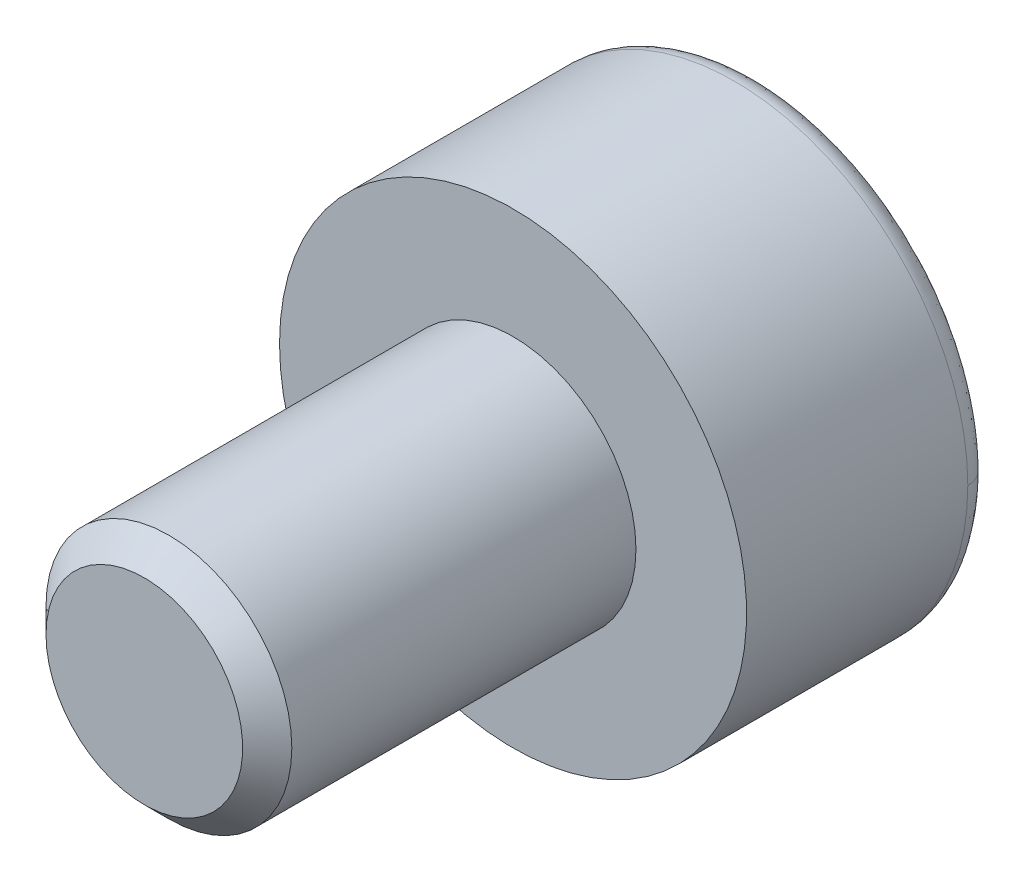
ISO-10303-21;
HEADER;
FILE_DESCRIPTION(('STEP AP214'),'2;1');
FILE_NAME('part.step','',(''),(''),'','','');
FILE_SCHEMA(('AUTOMOTIVE_DESIGN { 1 0 10303 214 1 1 1 1 }'));
ENDSEC;
DATA;
#1=APPLICATION_CONTEXT('core data for automotive mechanical design processes');
#2=APPLICATION_PROTOCOL_DEFINITION('international standard','automotive_design',2000,#1);
#3=PRODUCT_CONTEXT('',#1,'mechanical');
#4=PRODUCT('Part','Part','',(#3));
#5=PRODUCT_RELATED_PRODUCT_CATEGORY('part','',(#4));
#6=PRODUCT_DEFINITION_FORMATION('','',#4);
#7=PRODUCT_DEFINITION_CONTEXT('part definition',#1,'design');
#8=PRODUCT_DEFINITION('design','',#6,#7);
#9=PRODUCT_DEFINITION_SHAPE('','',#8);
#10=(LENGTH_UNIT() NAMED_UNIT(*) SI_UNIT(.MILLI.,.METRE.));
#11=(NAMED_UNIT(*) PLANE_ANGLE_UNIT() SI_UNIT($,.RADIAN.));
#12=(NAMED_UNIT(*) SI_UNIT($,.STERADIAN.) SOLID_ANGLE_UNIT());
#13=UNCERTAINTY_MEASURE_WITH_UNIT(LENGTH_MEASURE(1.E-05),#10,'distance_accuracy_value','');
#14=(GEOMETRIC_REPRESENTATION_CONTEXT(3) GLOBAL_UNCERTAINTY_ASSIGNED_CONTEXT((#13)) GLOBAL_UNIT_ASSIGNED_CONTEXT((#10,
#11,#12)) REPRESENTATION_CONTEXT('',''));
#15=CARTESIAN_POINT('',(0.,0.,0.));
#16=DIRECTION('',(0.,0.,1.));
#17=DIRECTION('',(1.,0.,0.));
#18=AXIS2_PLACEMENT_3D('',#15,#16,#17);
#19=CARTESIAN_POINT('',(-0.75,-0.866025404,-1.));
#20=DIRECTION('',(0.,0.,1.));
#21=DIRECTION('',(1.,0.,0.));
#22=AXIS2_PLACEMENT_3D('',#19,#20,#21);
#23=PLANE('',#22);
#24=DIRECTION('',(0.866025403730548,0.500000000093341,0.));
#25=VECTOR('',#24,1.);
#26=CARTESIAN_POINT('',(0.375,-0.649519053,-1.));
#27=LINE('',#26,#25);
#28=CARTESIAN_POINT('',(-4.19262769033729E-10,-0.866025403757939,-1.));
#29=VERTEX_POINT('',#28);
#30=CARTESIAN_POINT('',(0.75,-0.433012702,-1.));
#31=VERTEX_POINT('',#30);
#32=EDGE_CURVE('E101',#29,#31,#27,.T.);
#33=ORIENTED_EDGE('',*,*,#32,.F.);
#34=DIRECTION('',(0.866025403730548,-0.500000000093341,0.));
#35=VECTOR('',#34,1.);
#36=CARTESIAN_POINT('',(-0.375,-0.649519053,-1.));
#37=LINE('',#36,#35);
#38=CARTESIAN_POINT('',(-0.75,-0.433012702,-1.));
#39=VERTEX_POINT('',#38);
#40=EDGE_CURVE('E110',#39,#29,#37,.T.);
#41=ORIENTED_EDGE('',*,*,#40,.F.);
#42=DIRECTION('',(0.,-1.,0.));
#43=VECTOR('',#42,1.);
#44=CARTESIAN_POINT('',(-0.75,0.,-1.));
#45=LINE('',#44,#43);
#46=CARTESIAN_POINT('',(-0.75,0.433012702,-1.));
#47=VERTEX_POINT('',#46);
#48=EDGE_CURVE('E74',#47,#39,#45,.T.);
#49=ORIENTED_EDGE('',*,*,#48,.F.);
#50=DIRECTION('',(-0.866025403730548,-0.500000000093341,0.));
#51=VECTOR('',#50,1.);
#52=CARTESIAN_POINT('',(-0.375,0.649519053,-1.));
#53=LINE('',#52,#51);
#54=CARTESIAN_POINT('',(4.19262775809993E-10,0.866025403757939,-1.));
#55=VERTEX_POINT('',#54);
#56=EDGE_CURVE('E79',#55,#47,#53,.T.);
#57=ORIENTED_EDGE('',*,*,#56,.F.);
#58=DIRECTION('',(-0.866025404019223,0.499999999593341,0.));
#59=VECTOR('',#58,1.);
#60=CARTESIAN_POINT('',(0.3750000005,0.649519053,-1.));
#61=LINE('',#60,#59);
#62=CARTESIAN_POINT('',(0.75000000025,0.433012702,-1.));
#63=VERTEX_POINT('',#62);
#64=EDGE_CURVE('E89',#63,#55,#61,.T.);
#65=ORIENTED_EDGE('',*,*,#64,.F.);
#66=DIRECTION('',(0.,1.,0.));
#67=VECTOR('',#66,1.);
#68=CARTESIAN_POINT('',(0.75,0.,-1.));
#69=LINE('',#68,#67);
#70=EDGE_CURVE('E92',#31,#63,#69,.T.);
#71=ORIENTED_EDGE('',*,*,#70,.F.);
#72=EDGE_LOOP('',(#33,#41,#49,#57,#65,#71));
#73=FACE_BOUND('',#72,.T.);
#74=ADVANCED_FACE('F17',(#73),#23,.F.);
#75=CARTESIAN_POINT('',(0.,0.866025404,-2.));
#76=DIRECTION('',(-0.499999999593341,-0.866025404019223,0.));
#77=DIRECTION('',(0.866025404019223,-0.499999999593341,0.));
#78=AXIS2_PLACEMENT_3D('',#75,#76,#77);
#79=PLANE('',#78);
#80=DIRECTION('',(0.866025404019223,-0.499999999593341,0.));
#81=VECTOR('',#80,1.);
#82=CARTESIAN_POINT('',(0.,0.866025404,-2.));
#83=LINE('',#82,#81);
#84=CARTESIAN_POINT('',(0.,0.866025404,-2.));
#85=VERTEX_POINT('',#84);
#86=CARTESIAN_POINT('',(0.750000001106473,0.433012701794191,-2.));
#87=VERTEX_POINT('',#86);
#88=EDGE_CURVE('E21',#85,#87,#83,.T.);
#89=ORIENTED_EDGE('',*,*,#88,.T.);
#90=DIRECTION('',(0.,0.,-1.));
#91=VECTOR('',#90,1.);
#92=CARTESIAN_POINT('',(0.75,0.433012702,-1.5));
#93=LINE('',#92,#91);
#94=EDGE_CURVE('E96',#63,#87,#93,.T.);
#95=ORIENTED_EDGE('',*,*,#94,.F.);
#96=ORIENTED_EDGE('',*,*,#64,.T.);
#97=DIRECTION('',(0.,0.,1.));
#98=VECTOR('',#97,1.);
#99=CARTESIAN_POINT('',(0.,0.866025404,-1.5));
#100=LINE('',#99,#98);
#101=EDGE_CURVE('E66',#85,#55,#100,.T.);
#102=ORIENTED_EDGE('',*,*,#101,.F.);
#103=EDGE_LOOP('',(#89,#95,#96,#102));
#104=FACE_BOUND('',#103,.T.);
#105=ADVANCED_FACE('F97',(#104),#79,.T.);
#106=CARTESIAN_POINT('',(0.75,-0.433012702,-2.));
#107=DIRECTION('',(-1.,0.,0.));
#108=DIRECTION('',(0.,0.,1.));
#109=AXIS2_PLACEMENT_3D('',#106,#107,#108);
#110=PLANE('',#109);
#111=DIRECTION('',(0.,-1.,0.));
#112=VECTOR('',#111,1.);
#113=CARTESIAN_POINT('',(0.750000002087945,0.,-2.));
#114=LINE('',#113,#112);
#115=CARTESIAN_POINT('',(0.750000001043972,-0.433012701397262,-2.));
#116=VERTEX_POINT('',#115);
#117=EDGE_CURVE('E240',#87,#116,#114,.T.);
#118=ORIENTED_EDGE('',*,*,#117,.T.);
#119=DIRECTION('',(0.,0.,-1.));
#120=VECTOR('',#119,1.);
#121=CARTESIAN_POINT('',(0.75,-0.433012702,-1.5));
#122=LINE('',#121,#120);
#123=EDGE_CURVE('E105',#31,#116,#122,.T.);
#124=ORIENTED_EDGE('',*,*,#123,.F.);
#125=ORIENTED_EDGE('',*,*,#70,.T.);
#126=ORIENTED_EDGE('',*,*,#94,.T.);
#127=EDGE_LOOP('',(#118,#124,#125,#126));
#128=FACE_BOUND('',#127,.T.);
#129=ADVANCED_FACE('F103',(#128),#110,.T.);
#130=CARTESIAN_POINT('',(0.75,-0.433012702,-2.));
#131=DIRECTION('',(-0.500000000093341,0.866025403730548,0.));
#132=DIRECTION('',(-0.866025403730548,-0.500000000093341,0.));
#133=AXIS2_PLACEMENT_3D('',#130,#131,#132);
#134=PLANE('',#133);
#135=DIRECTION('',(-0.866025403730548,-0.500000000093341,0.));
#136=VECTOR('',#135,1.);
#137=CARTESIAN_POINT('',(0.75,-0.433012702,-2.));
#138=LINE('',#137,#136);
#139=CARTESIAN_POINT('',(0.,-0.866025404,-2.));
#140=VERTEX_POINT('',#139);
#141=EDGE_CURVE('E242',#116,#140,#138,.T.);
#142=ORIENTED_EDGE('',*,*,#141,.T.);
#143=DIRECTION('',(0.,0.,-1.));
#144=VECTOR('',#143,1.);
#145=CARTESIAN_POINT('',(0.,-0.866025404,-1.5));
#146=LINE('',#145,#144);
#147=EDGE_CURVE('E113',#29,#140,#146,.T.);
#148=ORIENTED_EDGE('',*,*,#147,.F.);
#149=ORIENTED_EDGE('',*,*,#32,.T.);
#150=ORIENTED_EDGE('',*,*,#123,.T.);
#151=EDGE_LOOP('',(#142,#148,#149,#150));
#152=FACE_BOUND('',#151,.T.);
#153=ADVANCED_FACE('F197',(#152),#134,.T.);
#154=CARTESIAN_POINT('',(0.,-0.866025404,-2.));
#155=DIRECTION('',(0.500000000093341,0.866025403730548,0.));
#156=DIRECTION('',(-0.866025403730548,0.500000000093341,0.));
#157=AXIS2_PLACEMENT_3D('',#154,#155,#156);
#158=PLANE('',#157);
#159=DIRECTION('',(-0.866025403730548,0.500000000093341,0.));
#160=VECTOR('',#159,1.);
#161=CARTESIAN_POINT('',(0.,-0.866025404,-2.));
#162=LINE('',#161,#160);
#163=CARTESIAN_POINT('',(-0.750000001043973,-0.433012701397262,-2.));
#164=VERTEX_POINT('',#163);
#165=EDGE_CURVE('E239',#140,#164,#162,.T.);
#166=ORIENTED_EDGE('',*,*,#165,.T.);
#167=DIRECTION('',(0.,0.,-1.));
#168=VECTOR('',#167,1.);
#169=CARTESIAN_POINT('',(-0.75,-0.433012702,-1.5));
#170=LINE('',#169,#168);
#171=EDGE_CURVE('E115',#39,#164,#170,.T.);
#172=ORIENTED_EDGE('',*,*,#171,.F.);
#173=ORIENTED_EDGE('',*,*,#40,.T.);
#174=ORIENTED_EDGE('',*,*,#147,.T.);
#175=EDGE_LOOP('',(#166,#172,#173,#174));
#176=FACE_BOUND('',#175,.T.);
#177=ADVANCED_FACE('F200',(#176),#158,.T.);
#178=CARTESIAN_POINT('',(-0.75,-0.433012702,-1.));
#179=DIRECTION('',(1.,0.,0.));
#180=DIRECTION('',(0.,0.,-1.));
#181=AXIS2_PLACEMENT_3D('',#178,#179,#180);
#182=PLANE('',#181);
#183=DIRECTION('',(0.,1.,0.));
#184=VECTOR('',#183,1.);
#185=CARTESIAN_POINT('',(-0.750000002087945,0.,-2.));
#186=LINE('',#185,#184);
#187=CARTESIAN_POINT('',(-0.750000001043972,0.433012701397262,-2.));
#188=VERTEX_POINT('',#187);
#189=EDGE_CURVE('E236',#164,#188,#186,.T.);
#190=ORIENTED_EDGE('',*,*,#189,.T.);
#191=DIRECTION('',(0.,0.,-1.));
#192=VECTOR('',#191,1.);
#193=CARTESIAN_POINT('',(-0.75,0.433012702,-1.5));
#194=LINE('',#193,#192);
#195=EDGE_CURVE('E117',#47,#188,#194,.T.);
#196=ORIENTED_EDGE('',*,*,#195,.F.);
#197=ORIENTED_EDGE('',*,*,#48,.T.);
#198=ORIENTED_EDGE('',*,*,#171,.T.);
#199=EDGE_LOOP('',(#190,#196,#197,#198));
#200=FACE_BOUND('',#199,.T.);
#201=ADVANCED_FACE('F204',(#200),#182,.T.);
#202=CARTESIAN_POINT('',(-0.75,0.433012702,-2.));
#203=DIRECTION('',(0.500000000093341,-0.866025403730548,0.));
#204=DIRECTION('',(0.866025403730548,0.500000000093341,0.));
#205=AXIS2_PLACEMENT_3D('',#202,#203,#204);
#206=PLANE('',#205);
#207=DIRECTION('',(0.866025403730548,0.500000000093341,0.));
#208=VECTOR('',#207,1.);
#209=CARTESIAN_POINT('',(-0.75,0.433012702,-2.));
#210=LINE('',#209,#208);
#211=EDGE_CURVE('E238',#188,#85,#210,.T.);
#212=ORIENTED_EDGE('',*,*,#211,.T.);
#213=ORIENTED_EDGE('',*,*,#101,.T.);
#214=ORIENTED_EDGE('',*,*,#56,.T.);
#215=ORIENTED_EDGE('',*,*,#195,.T.);
#216=EDGE_LOOP('',(#212,#213,#214,#215));
#217=FACE_BOUND('',#216,.T.);
#218=ADVANCED_FACE('F208',(#217),#206,.T.);
#219=CARTESIAN_POINT('',(-1.720400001,-1.720434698,-2.));
#220=DIRECTION('',(0.,0.,1.));
#221=DIRECTION('',(1.,0.,0.));
#222=AXIS2_PLACEMENT_3D('',#219,#220,#221);
#223=PLANE('',#222);
#224=ORIENTED_EDGE('',*,*,#189,.F.);
#225=ORIENTED_EDGE('',*,*,#165,.F.);
#226=ORIENTED_EDGE('',*,*,#141,.F.);
#227=ORIENTED_EDGE('',*,*,#117,.F.);
#228=ORIENTED_EDGE('',*,*,#88,.F.);
#229=ORIENTED_EDGE('',*,*,#211,.F.);
#230=EDGE_LOOP('',(#224,#225,#226,#227,#228,#229));
#231=FACE_BOUND('',#230,.T.);
#232=CARTESIAN_POINT('',(1.70000000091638,0.,-2.00000000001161));
#233=CARTESIAN_POINT('',(1.70000000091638,3.40000000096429,-2.00000000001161));
#234=CARTESIAN_POINT('',(-1.70000000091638,3.40000000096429,-2.00000000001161));
#235=CARTESIAN_POINT('',(-1.70000000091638,0.,-2.00000000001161));
#236=(BOUNDED_CURVE() B_SPLINE_CURVE(3,(#232,#233,#234,#235),.UNSPECIFIED.,.F.,
.F.) B_SPLINE_CURVE_WITH_KNOTS((4,4),(0.,1.),
.UNSPECIFIED.) CURVE() GEOMETRIC_REPRESENTATION_ITEM() RATIONAL_B_SPLINE_CURVE((0.956578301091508,
0.318859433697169,0.318859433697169,0.956578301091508)) REPRESENTATION_ITEM(''));
#237=CARTESIAN_POINT('',(1.70000000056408,0.,-2.00000000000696));
#238=VERTEX_POINT('',#237);
#239=CARTESIAN_POINT('',(-1.70000000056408,0.,-2.00000000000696));
#240=VERTEX_POINT('',#239);
#241=EDGE_CURVE('E141',#238,#240,#236,.T.);
#242=ORIENTED_EDGE('',*,*,#241,.F.);
#243=CARTESIAN_POINT('',(-1.70000000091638,0.,-2.00000000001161));
#244=CARTESIAN_POINT('',(-1.70000000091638,-3.40000000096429,-2.00000000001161));
#245=CARTESIAN_POINT('',(1.70000000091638,-3.40000000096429,-2.00000000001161));
#246=CARTESIAN_POINT('',(1.70000000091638,0.,-2.00000000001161));
#247=(BOUNDED_CURVE() B_SPLINE_CURVE(3,(#243,#244,#245,#246),.UNSPECIFIED.,.F.,
.F.) B_SPLINE_CURVE_WITH_KNOTS((4,4),(0.,1.),
.UNSPECIFIED.) CURVE() GEOMETRIC_REPRESENTATION_ITEM() RATIONAL_B_SPLINE_CURVE((0.956578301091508,
0.318859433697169,0.318859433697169,0.956578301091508)) REPRESENTATION_ITEM(''));
#248=EDGE_CURVE('E252',#240,#238,#247,.T.);
#249=ORIENTED_EDGE('',*,*,#248,.F.);
#250=EDGE_LOOP('',(#242,#249));
#251=FACE_BOUND('',#250,.T.);
#252=ADVANCED_FACE('F212',(#231,#251),#223,.F.);
#253=CARTESIAN_POINT('',(1.680033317,0.,-1.999000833));
#254=CARTESIAN_POINT('',(1.680033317,-3.360066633,-1.999000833));
#255=CARTESIAN_POINT('',(-1.680033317,-3.360066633,-1.999000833));
#256=CARTESIAN_POINT('',(-1.680033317,0.,-1.999000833));
#257=CARTESIAN_POINT('',(1.816010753,0.,-2.012644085));
#258=CARTESIAN_POINT('',(1.816010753,-3.632021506,-2.012644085));
#259=CARTESIAN_POINT('',(-1.816010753,-3.632021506,-2.012644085));
#260=CARTESIAN_POINT('',(-1.816010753,0.,-2.012644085));
#261=CARTESIAN_POINT('',(1.912644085,0.,-1.916010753));
#262=CARTESIAN_POINT('',(1.912644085,-3.825288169,-1.916010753));
#263=CARTESIAN_POINT('',(-1.912644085,-3.825288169,-1.916010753));
#264=CARTESIAN_POINT('',(-1.912644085,0.,-1.916010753));
#265=CARTESIAN_POINT('',(1.899000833,0.,-1.780033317));
#266=CARTESIAN_POINT('',(1.899000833,-3.798001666,-1.780033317));
#267=CARTESIAN_POINT('',(-1.899000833,-3.798001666,-1.780033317));
#268=CARTESIAN_POINT('',(-1.899000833,0.,-1.780033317));
#269=(BOUNDED_SURFACE() B_SPLINE_SURFACE(3,3,((#253,#254,#255,#256),(#257,#258,#259,#260),(#261,
#262,#263,#264),(#265,#266,#267,#268)),.UNSPECIFIED.,.F.,.F.,
.F.) B_SPLINE_SURFACE_WITH_KNOTS((4,4),(4,4),(0.,1.),(0.,1.),
.UNSPECIFIED.) GEOMETRIC_REPRESENTATION_ITEM() RATIONAL_B_SPLINE_SURFACE(((1.,0.333333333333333,
0.333333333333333,1.),(0.755320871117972,0.251773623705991,0.251773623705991,0.755320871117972),
(0.755320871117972,0.251773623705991,0.251773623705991,0.755320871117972),(1.,0.333333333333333,
0.333333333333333,1.))) REPRESENTATION_ITEM('') SURFACE());
#270=CARTESIAN_POINT('',(1.680033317,0.,-1.999000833));
#271=CARTESIAN_POINT('',(1.816010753,0.,-2.012644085));
#272=CARTESIAN_POINT('',(1.912644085,0.,-1.916010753));
#273=CARTESIAN_POINT('',(1.899000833,0.,-1.780033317));
#274=(BOUNDED_CURVE() B_SPLINE_CURVE(3,(#270,#271,#272,#273),.UNSPECIFIED.,.F.,
.F.) B_SPLINE_CURVE_WITH_KNOTS((4,4),(0.,1.),
.UNSPECIFIED.) CURVE() GEOMETRIC_REPRESENTATION_ITEM() RATIONAL_B_SPLINE_CURVE((1.,
0.755320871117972,0.755320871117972,1.)) REPRESENTATION_ITEM(''));
#275=CARTESIAN_POINT('',(1.9000000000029,-5.84544771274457E-10,-1.80000000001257));
#276=VERTEX_POINT('',#275);
#277=EDGE_CURVE('E36',#276,#238,#274,.F.);
#278=CARTESIAN_POINT('',(0.,0.,-1.8));
#279=DIRECTION('',(0.,0.,-1.));
#280=DIRECTION('',(-1.,0.,0.));
#281=AXIS2_PLACEMENT_3D('',#278,#279,#280);
#282=CIRCLE('',#281,1.9);
#283=CARTESIAN_POINT('',(-1.9000000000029,-8.53039470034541E-11,-1.8));
#284=VERTEX_POINT('',#283);
#285=EDGE_CURVE('E121',#276,#284,#282,.T.);
#286=CARTESIAN_POINT('',(-1.680033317,0.,-1.999000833));
#287=CARTESIAN_POINT('',(-1.816010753,0.,-2.012644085));
#288=CARTESIAN_POINT('',(-1.912644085,0.,-1.916010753));
#289=CARTESIAN_POINT('',(-1.899000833,0.,-1.780033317));
#290=(BOUNDED_CURVE() B_SPLINE_CURVE(3,(#286,#287,#288,#289),.UNSPECIFIED.,.F.,
.F.) B_SPLINE_CURVE_WITH_KNOTS((4,4),(0.,1.),
.UNSPECIFIED.) CURVE() GEOMETRIC_REPRESENTATION_ITEM() RATIONAL_B_SPLINE_CURVE((1.,
0.755320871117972,0.755320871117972,1.)) REPRESENTATION_ITEM(''));
#291=EDGE_CURVE('E131',#240,#284,#290,.T.);
#292=ORIENTED_EDGE('',*,*,#277,.F.);
#293=ORIENTED_EDGE('',*,*,#285,.T.);
#294=ORIENTED_EDGE('',*,*,#291,.F.);
#295=ORIENTED_EDGE('',*,*,#248,.T.);
#296=EDGE_LOOP('',(#292,#293,#294,#295));
#297=FACE_BOUND('',#296,.T.);
#298=ADVANCED_FACE('F170',(#297),#269,.T.);
#299=CARTESIAN_POINT('',(-1.680033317,0.,-1.999000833));
#300=CARTESIAN_POINT('',(-1.680033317,3.360066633,-1.999000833));
#301=CARTESIAN_POINT('',(1.680033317,3.360066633,-1.999000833));
#302=CARTESIAN_POINT('',(1.680033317,0.,-1.999000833));
#303=CARTESIAN_POINT('',(-1.816010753,0.,-2.012644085));
#304=CARTESIAN_POINT('',(-1.816010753,3.632021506,-2.012644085));
#305=CARTESIAN_POINT('',(1.816010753,3.632021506,-2.012644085));
#306=CARTESIAN_POINT('',(1.816010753,0.,-2.012644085));
#307=CARTESIAN_POINT('',(-1.912644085,0.,-1.916010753));
#308=CARTESIAN_POINT('',(-1.912644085,3.825288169,-1.916010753));
#309=CARTESIAN_POINT('',(1.912644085,3.825288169,-1.916010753));
#310=CARTESIAN_POINT('',(1.912644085,0.,-1.916010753));
#311=CARTESIAN_POINT('',(-1.899000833,0.,-1.780033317));
#312=CARTESIAN_POINT('',(-1.899000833,3.798001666,-1.780033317));
#313=CARTESIAN_POINT('',(1.899000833,3.798001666,-1.780033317));
#314=CARTESIAN_POINT('',(1.899000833,0.,-1.780033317));
#315=(BOUNDED_SURFACE() B_SPLINE_SURFACE(3,3,((#299,#300,#301,#302),(#303,#304,#305,#306),(#307,
#308,#309,#310),(#311,#312,#313,#314)),.UNSPECIFIED.,.F.,.F.,
.F.) B_SPLINE_SURFACE_WITH_KNOTS((4,4),(4,4),(0.,1.),(0.,1.),
.UNSPECIFIED.) GEOMETRIC_REPRESENTATION_ITEM() RATIONAL_B_SPLINE_SURFACE(((1.,0.333333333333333,
0.333333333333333,1.),(0.755320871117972,0.251773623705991,0.251773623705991,0.755320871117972),
(0.755320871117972,0.251773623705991,0.251773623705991,0.755320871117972),(1.,0.333333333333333,
0.333333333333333,1.))) REPRESENTATION_ITEM('') SURFACE());
#316=CARTESIAN_POINT('',(0.,0.,-1.8));
#317=DIRECTION('',(0.,0.,-1.));
#318=DIRECTION('',(-1.,0.,0.));
#319=AXIS2_PLACEMENT_3D('',#316,#317,#318);
#320=CIRCLE('',#319,1.9);
#321=EDGE_CURVE('E123',#284,#276,#320,.T.);
#322=ORIENTED_EDGE('',*,*,#321,.T.);
#323=ORIENTED_EDGE('',*,*,#277,.T.);
#324=ORIENTED_EDGE('',*,*,#241,.T.);
#325=ORIENTED_EDGE('',*,*,#291,.T.);
#326=EDGE_LOOP('',(#322,#323,#324,#325));
#327=FACE_BOUND('',#326,.T.);
#328=ADVANCED_FACE('F157',(#327),#315,.T.);
#329=CARTESIAN_POINT('',(0.,0.,0.));
#330=DIRECTION('',(0.,0.,-1.));
#331=DIRECTION('',(-1.,0.,0.));
#332=AXIS2_PLACEMENT_3D('',#329,#330,#331);
#333=CYLINDRICAL_SURFACE('',#332,1.9);
#334=ORIENTED_EDGE('',*,*,#321,.F.);
#335=ORIENTED_EDGE('',*,*,#285,.F.);
#336=EDGE_LOOP('',(#334,#335));
#337=FACE_BOUND('',#336,.T.);
#338=CARTESIAN_POINT('',(0.,0.,0.));
#339=DIRECTION('',(0.,0.,-1.));
#340=DIRECTION('',(-1.,0.,0.));
#341=AXIS2_PLACEMENT_3D('',#338,#339,#340);
#342=CIRCLE('',#341,1.9);
#343=CARTESIAN_POINT('',(-1.9,0.,0.));
#344=VERTEX_POINT('',#343);
#345=EDGE_CURVE('E127',#344,#344,#342,.T.);
#346=ORIENTED_EDGE('',*,*,#345,.T.);
#347=EDGE_LOOP('',(#346));
#348=FACE_BOUND('',#347,.T.);
#349=ADVANCED_FACE('F169',(#337,#348),#333,.T.);
#350=CARTESIAN_POINT('',(1.9228,-1.9228,0.));
#351=DIRECTION('',(0.,0.,-1.));
#352=DIRECTION('',(-1.,0.,0.));
#353=AXIS2_PLACEMENT_3D('',#350,#351,#352);
#354=PLANE('',#353);
#355=CARTESIAN_POINT('',(0.,0.,0.));
#356=DIRECTION('',(0.,0.,1.));
#357=DIRECTION('',(1.,0.,0.));
#358=AXIS2_PLACEMENT_3D('',#355,#356,#357);
#359=CIRCLE('',#358,1.);
#360=CARTESIAN_POINT('',(1.,0.,0.));
#361=VERTEX_POINT('',#360);
#362=EDGE_CURVE('E120',#361,#361,#359,.F.);
#363=ORIENTED_EDGE('',*,*,#362,.T.);
#364=EDGE_LOOP('',(#363));
#365=FACE_BOUND('',#364,.T.);
#366=ORIENTED_EDGE('',*,*,#345,.F.);
#367=EDGE_LOOP('',(#366));
#368=FACE_BOUND('',#367,.T.);
#369=ADVANCED_FACE('F181',(#365,#368),#354,.F.);
#370=CARTESIAN_POINT('',(0.,0.,0.));
#371=DIRECTION('',(0.,0.,1.));
#372=DIRECTION('',(1.,0.,0.));
#373=AXIS2_PLACEMENT_3D('',#370,#371,#372);
#374=CYLINDRICAL_SURFACE('',#373,1.);
#375=CARTESIAN_POINT('',(0.,0.,2.79999999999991));
#376=DIRECTION('',(0.,0.,-1.));
#377=DIRECTION('',(-1.,0.,0.));
#378=AXIS2_PLACEMENT_3D('',#375,#376,#377);
#379=CIRCLE('',#378,1.);
#380=CARTESIAN_POINT('',(-1.,0.,2.8));
#381=VERTEX_POINT('',#380);
#382=EDGE_CURVE('E27',#381,#381,#379,.T.);
#383=ORIENTED_EDGE('',*,*,#382,.T.);
#384=EDGE_LOOP('',(#383));
#385=FACE_BOUND('',#384,.T.);
#386=ORIENTED_EDGE('',*,*,#362,.F.);
#387=EDGE_LOOP('',(#386));
#388=FACE_BOUND('',#387,.T.);
#389=ADVANCED_FACE('F183',(#385,#388),#374,.T.);
#390=CARTESIAN_POINT('',(-0.8096,-0.8096,3.));
#391=DIRECTION('',(0.,0.,1.));
#392=DIRECTION('',(1.,0.,0.));
#393=AXIS2_PLACEMENT_3D('',#390,#391,#392);
#394=PLANE('',#393);
#395=CARTESIAN_POINT('',(0.,0.,2.99999999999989));
#396=DIRECTION('',(0.,0.,-1.));
#397=DIRECTION('',(-1.,0.,0.));
#398=AXIS2_PLACEMENT_3D('',#395,#396,#397);
#399=CIRCLE('',#398,0.800000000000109);
#400=CARTESIAN_POINT('',(-0.800000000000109,0.,2.99999999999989));
#401=VERTEX_POINT('',#400);
#402=EDGE_CURVE('E11',#401,#401,#399,.F.);
#403=ORIENTED_EDGE('',*,*,#402,.T.);
#404=EDGE_LOOP('',(#403));
#405=FACE_BOUND('',#404,.T.);
#406=ADVANCED_FACE('F19',(#405),#394,.T.);
#407=CARTESIAN_POINT('',(0.,0.,3.));
#408=DIRECTION('',(0.,0.,-1.));
#409=DIRECTION('',(-1.,0.,0.));
#410=AXIS2_PLACEMENT_3D('',#407,#408,#409);
#411=CONICAL_SURFACE('',#410,0.8,0.785398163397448);
#412=ORIENTED_EDGE('',*,*,#402,.F.);
#413=EDGE_LOOP('',(#412));
#414=FACE_BOUND('',#413,.T.);
#415=ORIENTED_EDGE('',*,*,#382,.F.);
#416=EDGE_LOOP('',(#415));
#417=FACE_BOUND('',#416,.T.);
#418=ADVANCED_FACE('F187',(#414,#417),#411,.T.);
#419=CLOSED_SHELL('',(#74,#105,#129,#153,#177,#201,#218,#252,#298,#328,#349,#369,#389,#406,#418));
#420=MANIFOLD_SOLID_BREP('B1',#419);
#421=ADVANCED_BREP_SHAPE_REPRESENTATION('',(#18,#420),#14);
#422=SHAPE_DEFINITION_REPRESENTATION(#9,#421);
ENDSEC;
END-ISO-10303-21;
